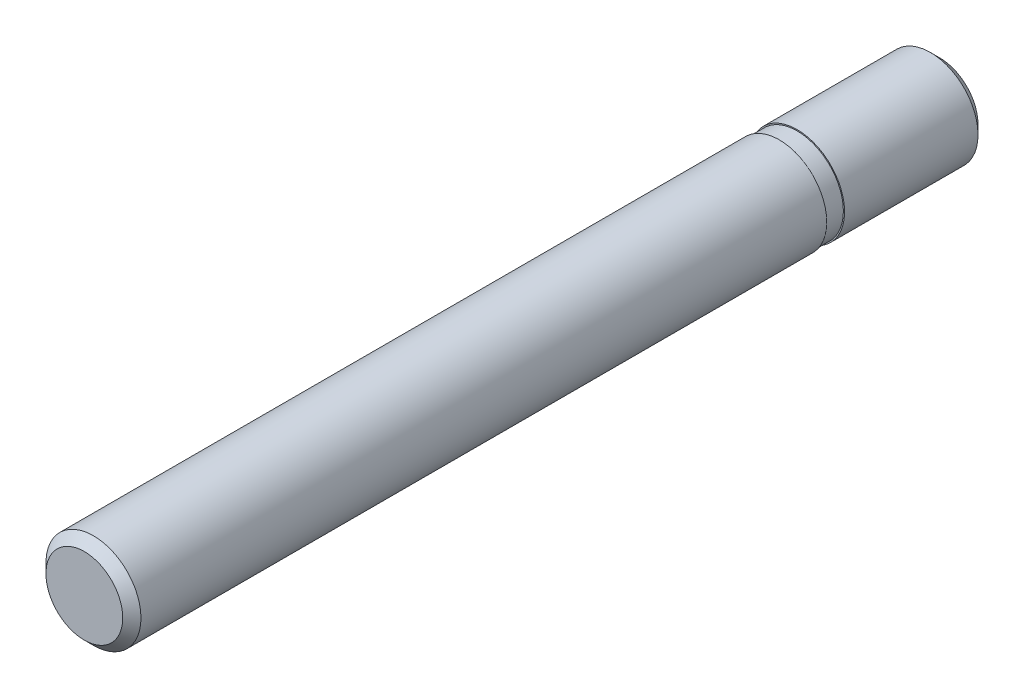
ISO-10303-21;
HEADER;
FILE_DESCRIPTION(('STEP AP214'),'2;1');
FILE_NAME('part.step','',(''),(''),'','','');
FILE_SCHEMA(('AUTOMOTIVE_DESIGN { 1 0 10303 214 1 1 1 1 }'));
ENDSEC;
DATA;
#1=APPLICATION_CONTEXT('core data for automotive mechanical design processes');
#2=APPLICATION_PROTOCOL_DEFINITION('international standard','automotive_design',2000,#1);
#3=PRODUCT_CONTEXT('',#1,'mechanical');
#4=PRODUCT('Part','Part','',(#3));
#5=PRODUCT_RELATED_PRODUCT_CATEGORY('part','',(#4));
#6=PRODUCT_DEFINITION_FORMATION('','',#4);
#7=PRODUCT_DEFINITION_CONTEXT('part definition',#1,'design');
#8=PRODUCT_DEFINITION('design','',#6,#7);
#9=PRODUCT_DEFINITION_SHAPE('','',#8);
#10=(LENGTH_UNIT() NAMED_UNIT(*) SI_UNIT(.MILLI.,.METRE.));
#11=(NAMED_UNIT(*) PLANE_ANGLE_UNIT() SI_UNIT($,.RADIAN.));
#12=(NAMED_UNIT(*) SI_UNIT($,.STERADIAN.) SOLID_ANGLE_UNIT());
#13=UNCERTAINTY_MEASURE_WITH_UNIT(LENGTH_MEASURE(1.E-05),#10,'distance_accuracy_value','');
#14=(GEOMETRIC_REPRESENTATION_CONTEXT(3) GLOBAL_UNCERTAINTY_ASSIGNED_CONTEXT((#13)) GLOBAL_UNIT_ASSIGNED_CONTEXT((#10,
#11,#12)) REPRESENTATION_CONTEXT('',''));
#15=CARTESIAN_POINT('',(0.,0.,0.));
#16=DIRECTION('',(0.,0.,1.));
#17=DIRECTION('',(1.,0.,0.));
#18=AXIS2_PLACEMENT_3D('',#15,#16,#17);
#19=CARTESIAN_POINT('',(0.,1.6165,-12.));
#20=DIRECTION('',(0.,0.,-1.));
#21=DIRECTION('',(-1.,0.,0.));
#22=AXIS2_PLACEMENT_3D('',#19,#20,#21);
#23=PLANE('',#22);
#24=CARTESIAN_POINT('',(0.,0.,-12.0000000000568));
#25=DIRECTION('',(0.,0.,1.));
#26=DIRECTION('',(1.,0.,0.));
#27=AXIS2_PLACEMENT_3D('',#24,#25,#26);
#28=CIRCLE('',#27,3.23300000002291);
#29=CARTESIAN_POINT('',(3.23300000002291,0.,-12.0000000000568));
#30=VERTEX_POINT('',#29);
#31=EDGE_CURVE('E19',#30,#30,#28,.T.);
#32=ORIENTED_EDGE('',*,*,#31,.F.);
#33=EDGE_LOOP('',(#32));
#34=FACE_BOUND('',#33,.T.);
#35=ADVANCED_FACE('F12',(#34),#23,.T.);
#36=CARTESIAN_POINT('',(0.,0.,-11.2330000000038));
#37=DIRECTION('',(0.,0.,1.));
#38=DIRECTION('',(1.,0.,0.));
#39=AXIS2_PLACEMENT_3D('',#36,#37,#38);
#40=CONICAL_SURFACE('',#39,4.00000000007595,0.785398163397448);
#41=CARTESIAN_POINT('',(0.,0.,-11.233));
#42=DIRECTION('',(0.,0.,1.));
#43=DIRECTION('',(1.,0.,0.));
#44=AXIS2_PLACEMENT_3D('',#41,#42,#43);
#45=CIRCLE('',#44,4.);
#46=CARTESIAN_POINT('',(4.,0.,-11.233));
#47=VERTEX_POINT('',#46);
#48=EDGE_CURVE('E23',#47,#47,#45,.T.);
#49=ORIENTED_EDGE('',*,*,#48,.F.);
#50=EDGE_LOOP('',(#49));
#51=FACE_BOUND('',#50,.T.);
#52=ORIENTED_EDGE('',*,*,#31,.T.);
#53=EDGE_LOOP('',(#52));
#54=FACE_BOUND('',#53,.T.);
#55=ADVANCED_FACE('F66',(#51,#54),#40,.T.);
#56=CARTESIAN_POINT('',(0.,0.,4.75));
#57=DIRECTION('',(0.,0.,1.));
#58=DIRECTION('',(1.,0.,0.));
#59=AXIS2_PLACEMENT_3D('',#56,#57,#58);
#60=CYLINDRICAL_SURFACE('',#59,4.);
#61=CARTESIAN_POINT('',(0.,0.,0.));
#62=DIRECTION('',(0.,0.,1.));
#63=DIRECTION('',(1.,0.,0.));
#64=AXIS2_PLACEMENT_3D('',#61,#62,#63);
#65=CIRCLE('',#64,4.);
#66=CARTESIAN_POINT('',(4.,0.,0.));
#67=VERTEX_POINT('',#66);
#68=EDGE_CURVE('E28',#67,#67,#65,.T.);
#69=ORIENTED_EDGE('',*,*,#68,.F.);
#70=EDGE_LOOP('',(#69));
#71=FACE_BOUND('',#70,.T.);
#72=ORIENTED_EDGE('',*,*,#48,.T.);
#73=EDGE_LOOP('',(#72));
#74=FACE_BOUND('',#73,.T.);
#75=ADVANCED_FACE('F72',(#71,#74),#60,.T.);
#76=CARTESIAN_POINT('',(0.,0.,0.));
#77=DIRECTION('',(0.,0.,1.));
#78=DIRECTION('',(1.,0.,0.));
#79=AXIS2_PLACEMENT_3D('',#76,#77,#78);
#80=PLANE('',#79);
#81=CARTESIAN_POINT('',(0.,0.,0.));
#82=DIRECTION('',(0.,0.,1.));
#83=DIRECTION('',(1.,0.,0.));
#84=AXIS2_PLACEMENT_3D('',#81,#82,#83);
#85=CIRCLE('',#84,3.9);
#86=CARTESIAN_POINT('',(3.9,0.,0.));
#87=VERTEX_POINT('',#86);
#88=EDGE_CURVE('E8',#87,#87,#85,.T.);
#89=ORIENTED_EDGE('',*,*,#88,.F.);
#90=EDGE_LOOP('',(#89));
#91=FACE_BOUND('',#90,.T.);
#92=ORIENTED_EDGE('',*,*,#68,.T.);
#93=EDGE_LOOP('',(#92));
#94=FACE_BOUND('',#93,.T.);
#95=ADVANCED_FACE('F77',(#91,#94),#80,.T.);
#96=CARTESIAN_POINT('',(0.,0.,-2.97753913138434));
#97=DIRECTION('',(0.,0.,-1.));
#98=DIRECTION('',(-1.,0.,0.));
#99=AXIS2_PLACEMENT_3D('',#96,#97,#98);
#100=CYLINDRICAL_SURFACE('',#99,3.9);
#101=CARTESIAN_POINT('',(0.,0.,1.5));
#102=DIRECTION('',(0.,0.,-1.));
#103=DIRECTION('',(-1.,0.,0.));
#104=AXIS2_PLACEMENT_3D('',#101,#102,#103);
#105=CIRCLE('',#104,3.9);
#106=CARTESIAN_POINT('',(-3.9,0.,1.5));
#107=VERTEX_POINT('',#106);
#108=EDGE_CURVE('E44',#107,#107,#105,.T.);
#109=ORIENTED_EDGE('',*,*,#108,.T.);
#110=EDGE_LOOP('',(#109));
#111=FACE_BOUND('',#110,.T.);
#112=ORIENTED_EDGE('',*,*,#88,.T.);
#113=EDGE_LOOP('',(#112));
#114=FACE_BOUND('',#113,.T.);
#115=ADVANCED_FACE('F51',(#111,#114),#100,.T.);
#116=CARTESIAN_POINT('',(0.,0.,60.));
#117=DIRECTION('',(0.,0.,1.));
#118=DIRECTION('',(1.,0.,0.));
#119=AXIS2_PLACEMENT_3D('',#116,#117,#118);
#120=PLANE('',#119);
#121=CARTESIAN_POINT('',(0.,0.,60.));
#122=DIRECTION('',(0.,0.,1.));
#123=DIRECTION('',(1.,0.,0.));
#124=AXIS2_PLACEMENT_3D('',#121,#122,#123);
#125=CIRCLE('',#124,3.233);
#126=CARTESIAN_POINT('',(3.233,0.,60.));
#127=VERTEX_POINT('',#126);
#128=EDGE_CURVE('E40',#127,#127,#125,.T.);
#129=ORIENTED_EDGE('',*,*,#128,.T.);
#130=EDGE_LOOP('',(#129));
#131=FACE_BOUND('',#130,.T.);
#132=ADVANCED_FACE('F85',(#131),#120,.T.);
#133=CARTESIAN_POINT('',(0.,0.,60.));
#134=DIRECTION('',(0.,0.,-1.));
#135=DIRECTION('',(-1.,0.,0.));
#136=AXIS2_PLACEMENT_3D('',#133,#134,#135);
#137=CONICAL_SURFACE('',#136,3.233,0.785398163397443);
#138=CARTESIAN_POINT('',(0.,0.,59.233));
#139=DIRECTION('',(0.,0.,1.));
#140=DIRECTION('',(1.,0.,0.));
#141=AXIS2_PLACEMENT_3D('',#138,#139,#140);
#142=CIRCLE('',#141,4.);
#143=CARTESIAN_POINT('',(4.,0.,59.233));
#144=VERTEX_POINT('',#143);
#145=EDGE_CURVE('E31',#144,#144,#142,.F.);
#146=ORIENTED_EDGE('',*,*,#145,.F.);
#147=EDGE_LOOP('',(#146));
#148=FACE_BOUND('',#147,.T.);
#149=ORIENTED_EDGE('',*,*,#128,.F.);
#150=EDGE_LOOP('',(#149));
#151=FACE_BOUND('',#150,.T.);
#152=ADVANCED_FACE('F62',(#148,#151),#137,.T.);
#153=CARTESIAN_POINT('',(0.,0.,4.75));
#154=DIRECTION('',(0.,0.,1.));
#155=DIRECTION('',(1.,0.,0.));
#156=AXIS2_PLACEMENT_3D('',#153,#154,#155);
#157=CYLINDRICAL_SURFACE('',#156,4.);
#158=CARTESIAN_POINT('',(0.,0.,1.5));
#159=DIRECTION('',(0.,0.,1.));
#160=DIRECTION('',(1.,0.,0.));
#161=AXIS2_PLACEMENT_3D('',#158,#159,#160);
#162=CIRCLE('',#161,4.);
#163=CARTESIAN_POINT('',(4.,0.,1.5));
#164=VERTEX_POINT('',#163);
#165=EDGE_CURVE('E35',#164,#164,#162,.T.);
#166=ORIENTED_EDGE('',*,*,#165,.T.);
#167=EDGE_LOOP('',(#166));
#168=FACE_BOUND('',#167,.T.);
#169=ORIENTED_EDGE('',*,*,#145,.T.);
#170=EDGE_LOOP('',(#169));
#171=FACE_BOUND('',#170,.T.);
#172=ADVANCED_FACE('F14',(#168,#171),#157,.T.);
#173=CARTESIAN_POINT('',(0.,0.,1.5));
#174=DIRECTION('',(0.,0.,1.));
#175=DIRECTION('',(1.,0.,0.));
#176=AXIS2_PLACEMENT_3D('',#173,#174,#175);
#177=PLANE('',#176);
#178=ORIENTED_EDGE('',*,*,#108,.F.);
#179=EDGE_LOOP('',(#178));
#180=FACE_BOUND('',#179,.T.);
#181=ORIENTED_EDGE('',*,*,#165,.F.);
#182=EDGE_LOOP('',(#181));
#183=FACE_BOUND('',#182,.T.);
#184=ADVANCED_FACE('F53',(#180,#183),#177,.F.);
#185=CLOSED_SHELL('',(#35,#55,#75,#95,#115,#132,#152,#172,#184));
#186=MANIFOLD_SOLID_BREP('B1',#185);
#187=ADVANCED_BREP_SHAPE_REPRESENTATION('',(#18,#186),#14);
#188=SHAPE_DEFINITION_REPRESENTATION(#9,#187);
ENDSEC;
END-ISO-10303-21;
